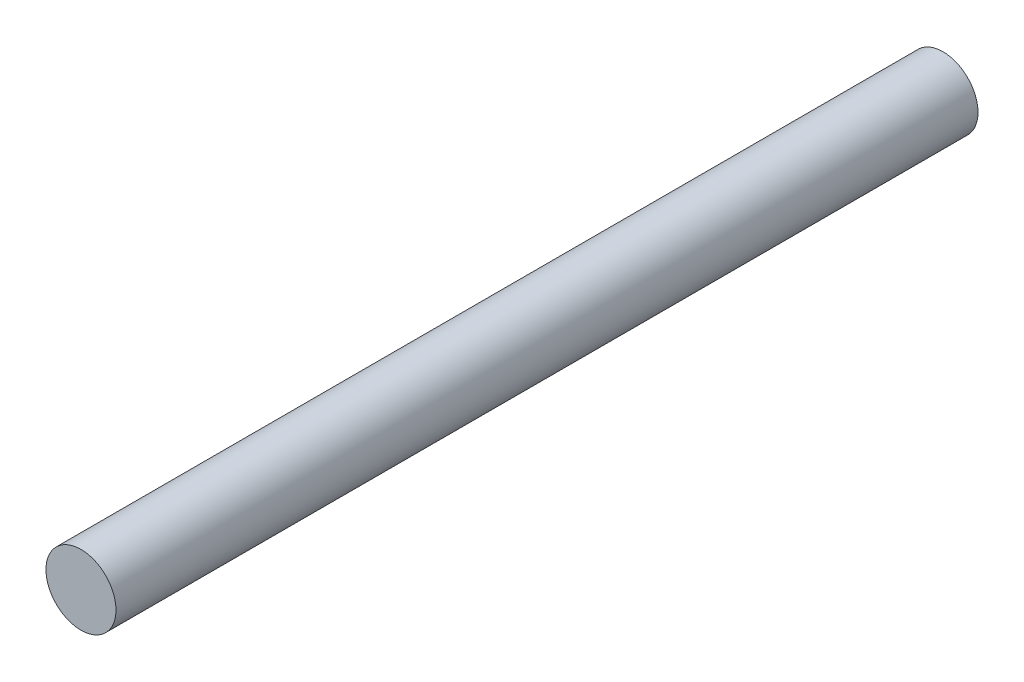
from build123d import *

# Parameters (mm, degrees)
ESQUISSE1_R        = 3.25
BOSS_EXTRU_1_DEPTH = 80


with BuildPart() as part:
    # Esquisse1 → Boss.-Extru.1 (new body)
    with BuildSketch(Plane.XY):
        with Locations((-9.654947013, 2.307719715)):
            Circle(ESQUISSE1_R)
    extrude(amount=BOSS_EXTRU_1_DEPTH)


solid = part.part
